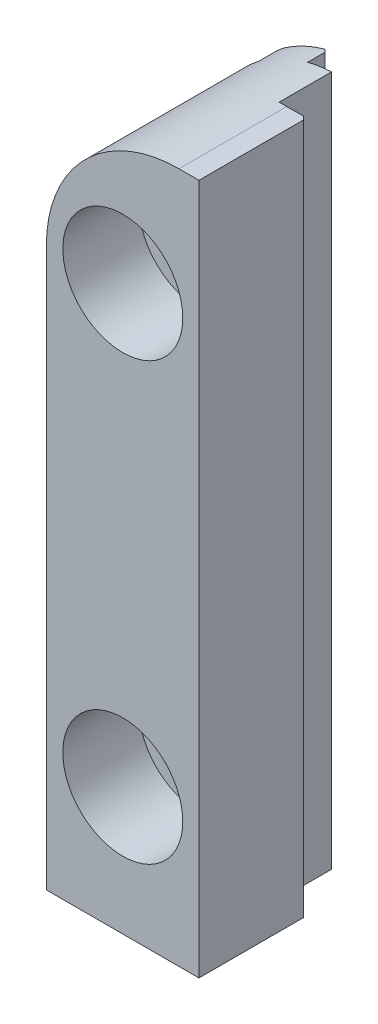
ISO-10303-21;
HEADER;
FILE_DESCRIPTION(('STEP AP214'),'2;1');
FILE_NAME('part.step','',(''),(''),'','','');
FILE_SCHEMA(('AUTOMOTIVE_DESIGN { 1 0 10303 214 1 1 1 1 }'));
ENDSEC;
DATA;
#1=APPLICATION_CONTEXT('core data for automotive mechanical design processes');
#2=APPLICATION_PROTOCOL_DEFINITION('international standard','automotive_design',2000,#1);
#3=PRODUCT_CONTEXT('',#1,'mechanical');
#4=PRODUCT('Part','Part','',(#3));
#5=PRODUCT_RELATED_PRODUCT_CATEGORY('part','',(#4));
#6=PRODUCT_DEFINITION_FORMATION('','',#4);
#7=PRODUCT_DEFINITION_CONTEXT('part definition',#1,'design');
#8=PRODUCT_DEFINITION('design','',#6,#7);
#9=PRODUCT_DEFINITION_SHAPE('','',#8);
#10=(LENGTH_UNIT() NAMED_UNIT(*) SI_UNIT(.MILLI.,.METRE.));
#11=(NAMED_UNIT(*) PLANE_ANGLE_UNIT() SI_UNIT($,.RADIAN.));
#12=(NAMED_UNIT(*) SI_UNIT($,.STERADIAN.) SOLID_ANGLE_UNIT());
#13=UNCERTAINTY_MEASURE_WITH_UNIT(LENGTH_MEASURE(1.E-05),#10,'distance_accuracy_value','');
#14=(GEOMETRIC_REPRESENTATION_CONTEXT(3) GLOBAL_UNCERTAINTY_ASSIGNED_CONTEXT((#13)) GLOBAL_UNIT_ASSIGNED_CONTEXT((#10,
#11,#12)) REPRESENTATION_CONTEXT('',''));
#15=CARTESIAN_POINT('',(0.,0.,0.));
#16=DIRECTION('',(0.,0.,1.));
#17=DIRECTION('',(1.,0.,0.));
#18=AXIS2_PLACEMENT_3D('',#15,#16,#17);
#19=CARTESIAN_POINT('',(-7.32028,25.146,-11.684));
#20=DIRECTION('',(0.,0.,-1.));
#21=DIRECTION('',(1.,0.,0.));
#22=AXIS2_PLACEMENT_3D('',#19,#20,#21);
#23=PLANE('',#22);
#24=CARTESIAN_POINT('',(-5.54228,-15.875,-11.684));
#25=DIRECTION('',(0.,0.,-1.));
#26=DIRECTION('',(-1.,0.,0.));
#27=AXIS2_PLACEMENT_3D('',#24,#25,#26);
#28=CIRCLE('',#27,2.7051);
#29=CARTESIAN_POINT('',(-8.24738,-15.875,-11.684));
#30=VERTEX_POINT('',#29);
#31=EDGE_CURVE('E486',#30,#30,#28,.F.);
#32=ORIENTED_EDGE('',*,*,#31,.T.);
#33=EDGE_LOOP('',(#32));
#34=FACE_BOUND('',#33,.T.);
#35=CARTESIAN_POINT('',(-5.54228,15.875,-11.684));
#36=DIRECTION('',(0.,0.,-1.));
#37=DIRECTION('',(-1.,0.,0.));
#38=AXIS2_PLACEMENT_3D('',#35,#36,#37);
#39=CIRCLE('',#38,2.7051);
#40=CARTESIAN_POINT('',(-8.24738,15.875,-11.684));
#41=VERTEX_POINT('',#40);
#42=EDGE_CURVE('E361',#41,#41,#39,.F.);
#43=ORIENTED_EDGE('',*,*,#42,.T.);
#44=EDGE_LOOP('',(#43));
#45=FACE_BOUND('',#44,.T.);
#46=CARTESIAN_POINT('',(-5.54228,-15.875,-11.684));
#47=DIRECTION('',(0.,0.,1.));
#48=DIRECTION('',(1.,0.,0.));
#49=AXIS2_PLACEMENT_3D('',#46,#47,#48);
#50=CIRCLE('',#49,3.175);
#51=CARTESIAN_POINT('',(-2.36728,-15.875,-11.684));
#52=VERTEX_POINT('',#51);
#53=CARTESIAN_POINT('',(-2.3672803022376,-15.8763853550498,-11.684));
#54=VERTEX_POINT('',#53);
#55=EDGE_CURVE('E333',#52,#54,#50,.T.);
#56=ORIENTED_EDGE('',*,*,#55,.F.);
#57=DIRECTION('',(-1.,0.,0.));
#58=VECTOR('',#57,1.);
#59=CARTESIAN_POINT('',(-7.32028,-15.875,-11.684));
#60=LINE('',#59,#58);
#61=CARTESIAN_POINT('',(-2.367026,-15.875,-11.684));
#62=VERTEX_POINT('',#61);
#63=EDGE_CURVE('E23',#52,#62,#60,.F.);
#64=ORIENTED_EDGE('',*,*,#63,.T.);
#65=CARTESIAN_POINT('',(-5.54228,-15.875,-11.684));
#66=DIRECTION('',(0.,0.,-1.));
#67=DIRECTION('',(-1.,0.,0.));
#68=AXIS2_PLACEMENT_3D('',#65,#66,#67);
#69=CIRCLE('',#68,3.175254);
#70=CARTESIAN_POINT('',(-3.76428,-13.2442293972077,-11.684));
#71=VERTEX_POINT('',#70);
#72=EDGE_CURVE('E243',#71,#62,#69,.T.);
#73=ORIENTED_EDGE('',*,*,#72,.F.);
#74=DIRECTION('',(0.,-1.,0.));
#75=VECTOR('',#74,1.);
#76=CARTESIAN_POINT('',(-3.76428,25.146,-11.684));
#77=LINE('',#76,#75);
#78=CARTESIAN_POINT('',(-3.76428,13.2442293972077,-11.684));
#79=VERTEX_POINT('',#78);
#80=EDGE_CURVE('E378',#79,#71,#77,.T.);
#81=ORIENTED_EDGE('',*,*,#80,.F.);
#82=CARTESIAN_POINT('',(-5.54228,15.875,-11.684));
#83=DIRECTION('',(0.,0.,-1.));
#84=DIRECTION('',(-1.,0.,0.));
#85=AXIS2_PLACEMENT_3D('',#82,#83,#84);
#86=CIRCLE('',#85,3.175254);
#87=CARTESIAN_POINT('',(-2.36702630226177,15.8736145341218,-11.684));
#88=VERTEX_POINT('',#87);
#89=EDGE_CURVE('E318',#88,#79,#86,.T.);
#90=ORIENTED_EDGE('',*,*,#89,.F.);
#91=DIRECTION('',(-0.999999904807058,0.000436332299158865,0.));
#92=VECTOR('',#91,1.);
#93=CARTESIAN_POINT('',(-7.32432489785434,15.8757775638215,-11.684));
#94=LINE('',#93,#92);
#95=CARTESIAN_POINT('',(-2.36728030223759,15.8736146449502,-11.684));
#96=VERTEX_POINT('',#95);
#97=EDGE_CURVE('E509',#88,#96,#94,.T.);
#98=ORIENTED_EDGE('',*,*,#97,.T.);
#99=CARTESIAN_POINT('',(-5.54228,15.875,-11.684));
#100=DIRECTION('',(0.,0.,1.));
#101=DIRECTION('',(1.,0.,0.));
#102=AXIS2_PLACEMENT_3D('',#99,#100,#101);
#103=CIRCLE('',#102,3.175);
#104=CARTESIAN_POINT('',(-2.36728,15.875,-11.684));
#105=VERTEX_POINT('',#104);
#106=EDGE_CURVE('E335',#105,#96,#103,.T.);
#107=ORIENTED_EDGE('',*,*,#106,.F.);
#108=DIRECTION('',(-1.,0.,0.));
#109=VECTOR('',#108,1.);
#110=CARTESIAN_POINT('',(-7.32028,15.875,-11.684));
#111=LINE('',#110,#109);
#112=CARTESIAN_POINT('',(-2.367026,15.875,-11.684));
#113=VERTEX_POINT('',#112);
#114=EDGE_CURVE('E506',#105,#113,#111,.F.);
#115=ORIENTED_EDGE('',*,*,#114,.T.);
#116=CARTESIAN_POINT('',(-3.76428,18.5057706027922,-11.684));
#117=VERTEX_POINT('',#116);
#118=EDGE_CURVE('E319',#117,#113,#86,.T.);
#119=ORIENTED_EDGE('',*,*,#118,.F.);
#120=CARTESIAN_POINT('',(-3.76428,24.8651543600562,-11.684));
#121=VERTEX_POINT('',#120);
#122=EDGE_CURVE('E374',#121,#117,#77,.T.);
#123=ORIENTED_EDGE('',*,*,#122,.F.);
#124=CARTESIAN_POINT('',(-1.45288,15.494,-11.684));
#125=DIRECTION('',(0.,0.,1.));
#126=DIRECTION('',(1.,0.,0.));
#127=AXIS2_PLACEMENT_3D('',#124,#125,#126);
#128=CIRCLE('',#127,9.652);
#129=CARTESIAN_POINT('',(-2.02438,25.1290657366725,-11.684));
#130=VERTEX_POINT('',#129);
#131=EDGE_CURVE('E392',#130,#121,#128,.T.);
#132=ORIENTED_EDGE('',*,*,#131,.F.);
#133=DIRECTION('',(0.,-1.,0.));
#134=VECTOR('',#133,1.);
#135=CARTESIAN_POINT('',(-2.02438,25.146,-11.684));
#136=LINE('',#135,#134);
#137=CARTESIAN_POINT('',(-2.02438,-25.146,-11.684));
#138=VERTEX_POINT('',#137);
#139=EDGE_CURVE('E377',#130,#138,#136,.T.);
#140=ORIENTED_EDGE('',*,*,#139,.T.);
#141=DIRECTION('',(-1.,0.,0.));
#142=VECTOR('',#141,1.);
#143=CARTESIAN_POINT('',(-1.96088,-25.146,-11.684));
#144=LINE('',#143,#142);
#145=CARTESIAN_POINT('',(-3.76428,-25.146,-11.684));
#146=VERTEX_POINT('',#145);
#147=EDGE_CURVE('E343',#138,#146,#144,.T.);
#148=ORIENTED_EDGE('',*,*,#147,.T.);
#149=CARTESIAN_POINT('',(-3.76428,-18.5057706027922,-11.684));
#150=VERTEX_POINT('',#149);
#151=EDGE_CURVE('E372',#150,#146,#77,.T.);
#152=ORIENTED_EDGE('',*,*,#151,.F.);
#153=CARTESIAN_POINT('',(-2.36702630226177,-15.8763854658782,-11.684));
#154=VERTEX_POINT('',#153);
#155=EDGE_CURVE('E270',#154,#150,#69,.T.);
#156=ORIENTED_EDGE('',*,*,#155,.F.);
#157=DIRECTION('',(-0.999999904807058,0.000436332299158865,0.));
#158=VECTOR('',#157,1.);
#159=CARTESIAN_POINT('',(-7.33817844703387,-15.874216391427,-11.684));
#160=LINE('',#159,#158);
#161=EDGE_CURVE('E9',#154,#54,#160,.T.);
#162=ORIENTED_EDGE('',*,*,#161,.T.);
#163=EDGE_LOOP('',(#56,#64,#73,#81,#90,#98,#107,#115,#119,#123,#132,#140,#148,#152,#156,#162));
#164=FACE_BOUND('',#163,.T.);
#165=ADVANCED_FACE('F15',(#34,#45,#164),#23,.T.);
#166=CARTESIAN_POINT('',(-7.32028,-18.5057706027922,-11.684));
#167=VERTEX_POINT('',#166);
#168=CARTESIAN_POINT('',(-7.32028,-13.2442293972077,-11.684));
#169=VERTEX_POINT('',#168);
#170=EDGE_CURVE('E273',#167,#169,#69,.T.);
#171=ORIENTED_EDGE('',*,*,#170,.F.);
#172=DIRECTION('',(0.,-1.,0.));
#173=VECTOR('',#172,1.);
#174=CARTESIAN_POINT('',(-7.32028,25.146,-11.684));
#175=LINE('',#174,#173);
#176=CARTESIAN_POINT('',(-7.32028,-25.146,-11.684));
#177=VERTEX_POINT('',#176);
#178=EDGE_CURVE('E367',#167,#177,#175,.T.);
#179=ORIENTED_EDGE('',*,*,#178,.T.);
#180=DIRECTION('',(-1.,0.,0.));
#181=VECTOR('',#180,1.);
#182=CARTESIAN_POINT('',(-7.32028,-25.146,-11.684));
#183=LINE('',#182,#181);
#184=CARTESIAN_POINT('',(-11.10488,-25.146,-11.684));
#185=VERTEX_POINT('',#184);
#186=EDGE_CURVE('E355',#177,#185,#183,.T.);
#187=ORIENTED_EDGE('',*,*,#186,.T.);
#188=DIRECTION('',(0.,-1.,0.));
#189=VECTOR('',#188,1.);
#190=CARTESIAN_POINT('',(-11.10488,25.146,-11.684));
#191=LINE('',#190,#189);
#192=CARTESIAN_POINT('',(-11.10488,15.494,-11.684));
#193=VERTEX_POINT('',#192);
#194=EDGE_CURVE('E365',#193,#185,#191,.T.);
#195=ORIENTED_EDGE('',*,*,#194,.F.);
#196=CARTESIAN_POINT('',(-1.45288,15.494,-11.684));
#197=DIRECTION('',(0.,0.,1.));
#198=DIRECTION('',(1.,0.,0.));
#199=AXIS2_PLACEMENT_3D('',#196,#197,#198);
#200=CIRCLE('',#199,9.652);
#201=CARTESIAN_POINT('',(-7.32028,23.1578581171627,-11.684));
#202=VERTEX_POINT('',#201);
#203=EDGE_CURVE('E397',#202,#193,#200,.T.);
#204=ORIENTED_EDGE('',*,*,#203,.F.);
#205=CARTESIAN_POINT('',(-7.32028,18.5057706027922,-11.684));
#206=VERTEX_POINT('',#205);
#207=EDGE_CURVE('E369',#202,#206,#175,.T.);
#208=ORIENTED_EDGE('',*,*,#207,.T.);
#209=CARTESIAN_POINT('',(-7.32028,13.2442293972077,-11.684));
#210=VERTEX_POINT('',#209);
#211=EDGE_CURVE('E315',#210,#206,#86,.T.);
#212=ORIENTED_EDGE('',*,*,#211,.F.);
#213=EDGE_CURVE('E373',#210,#169,#175,.T.);
#214=ORIENTED_EDGE('',*,*,#213,.T.);
#215=EDGE_LOOP('',(#171,#179,#187,#195,#204,#208,#212,#214));
#216=FACE_BOUND('',#215,.T.);
#217=ADVANCED_FACE('F552',(#216),#23,.T.);
#218=CARTESIAN_POINT('',(-3.76428,25.146,-11.684));
#219=DIRECTION('',(1.,0.,0.));
#220=DIRECTION('',(0.,0.,1.));
#221=AXIS2_PLACEMENT_3D('',#218,#219,#220);
#222=PLANE('',#221);
#223=DIRECTION('',(0.,0.,1.));
#224=VECTOR('',#223,1.);
#225=CARTESIAN_POINT('',(-3.76428,-18.5057706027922,-5.5372));
#226=LINE('',#225,#224);
#227=CARTESIAN_POINT('',(-3.76428,-18.5057706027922,-12.954));
#228=VERTEX_POINT('',#227);
#229=EDGE_CURVE('E38',#150,#228,#226,.F.);
#230=ORIENTED_EDGE('',*,*,#229,.F.);
#231=ORIENTED_EDGE('',*,*,#151,.T.);
#232=DIRECTION('',(0.,0.,-1.));
#233=VECTOR('',#232,1.);
#234=CARTESIAN_POINT('',(-3.76428,-25.146,-11.684));
#235=LINE('',#234,#233);
#236=CARTESIAN_POINT('',(-3.76428,-25.146,-12.954));
#237=VERTEX_POINT('',#236);
#238=EDGE_CURVE('E346',#146,#237,#235,.T.);
#239=ORIENTED_EDGE('',*,*,#238,.T.);
#240=DIRECTION('',(0.,1.,0.));
#241=VECTOR('',#240,1.);
#242=CARTESIAN_POINT('',(-3.76428,25.146,-12.954));
#243=LINE('',#242,#241);
#244=EDGE_CURVE('E444',#237,#228,#243,.T.);
#245=ORIENTED_EDGE('',*,*,#244,.T.);
#246=EDGE_LOOP('',(#230,#231,#239,#245));
#247=FACE_BOUND('',#246,.T.);
#248=ADVANCED_FACE('F524',(#247),#222,.T.);
#249=CARTESIAN_POINT('',(-3.76428,25.146,-13.208));
#250=DIRECTION('',(0.,0.,-1.));
#251=DIRECTION('',(1.,0.,0.));
#252=AXIS2_PLACEMENT_3D('',#249,#250,#251);
#253=PLANE('',#252);
#254=CARTESIAN_POINT('',(-5.54228,-15.875,-13.208));
#255=DIRECTION('',(0.,0.,-1.));
#256=DIRECTION('',(-1.,0.,0.));
#257=AXIS2_PLACEMENT_3D('',#254,#255,#256);
#258=CIRCLE('',#257,3.175254);
#259=CARTESIAN_POINT('',(-7.06628,-13.0893830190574,-13.208));
#260=VERTEX_POINT('',#259);
#261=CARTESIAN_POINT('',(-4.01828,-13.0893830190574,-13.208));
#262=VERTEX_POINT('',#261);
#263=EDGE_CURVE('E281',#260,#262,#258,.T.);
#264=ORIENTED_EDGE('',*,*,#263,.F.);
#265=DIRECTION('',(0.,1.,0.));
#266=VECTOR('',#265,1.);
#267=CARTESIAN_POINT('',(-7.06628,25.146,-13.208));
#268=LINE('',#267,#266);
#269=CARTESIAN_POINT('',(-7.06628,13.0893830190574,-13.208));
#270=VERTEX_POINT('',#269);
#271=EDGE_CURVE('E414',#260,#270,#268,.T.);
#272=ORIENTED_EDGE('',*,*,#271,.T.);
#273=CARTESIAN_POINT('',(-5.54228,15.875,-13.208));
#274=DIRECTION('',(0.,0.,-1.));
#275=DIRECTION('',(-1.,0.,0.));
#276=AXIS2_PLACEMENT_3D('',#273,#274,#275);
#277=CIRCLE('',#276,3.175254);
#278=CARTESIAN_POINT('',(-4.01828,13.0893830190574,-13.208));
#279=VERTEX_POINT('',#278);
#280=EDGE_CURVE('E325',#279,#270,#277,.T.);
#281=ORIENTED_EDGE('',*,*,#280,.F.);
#282=DIRECTION('',(0.,-1.,0.));
#283=VECTOR('',#282,1.);
#284=CARTESIAN_POINT('',(-4.01828,25.146,-13.208));
#285=LINE('',#284,#283);
#286=EDGE_CURVE('E411',#279,#262,#285,.T.);
#287=ORIENTED_EDGE('',*,*,#286,.T.);
#288=EDGE_LOOP('',(#264,#272,#281,#287));
#289=FACE_BOUND('',#288,.T.);
#290=ADVANCED_FACE('F566',(#289),#253,.T.);
#291=CARTESIAN_POINT('',(-7.32028,25.146,-13.208));
#292=DIRECTION('',(-1.,0.,0.));
#293=DIRECTION('',(0.,0.,-1.));
#294=AXIS2_PLACEMENT_3D('',#291,#292,#293);
#295=PLANE('',#294);
#296=DIRECTION('',(0.,0.,1.));
#297=VECTOR('',#296,1.);
#298=CARTESIAN_POINT('',(-7.32028,-13.2442293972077,-5.5372));
#299=LINE('',#298,#297);
#300=CARTESIAN_POINT('',(-7.32028,-13.2442293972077,-12.954));
#301=VERTEX_POINT('',#300);
#302=EDGE_CURVE('E277',#169,#301,#299,.F.);
#303=ORIENTED_EDGE('',*,*,#302,.F.);
#304=ORIENTED_EDGE('',*,*,#213,.F.);
#305=DIRECTION('',(0.,0.,1.));
#306=VECTOR('',#305,1.);
#307=CARTESIAN_POINT('',(-7.32028,13.2442293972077,-5.5372));
#308=LINE('',#307,#306);
#309=CARTESIAN_POINT('',(-7.32028,13.2442293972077,-12.954));
#310=VERTEX_POINT('',#309);
#311=EDGE_CURVE('E321',#310,#210,#308,.T.);
#312=ORIENTED_EDGE('',*,*,#311,.F.);
#313=DIRECTION('',(0.,-1.,0.));
#314=VECTOR('',#313,1.);
#315=CARTESIAN_POINT('',(-7.32028,25.146,-12.954));
#316=LINE('',#315,#314);
#317=EDGE_CURVE('E400',#310,#301,#316,.T.);
#318=ORIENTED_EDGE('',*,*,#317,.T.);
#319=EDGE_LOOP('',(#303,#304,#312,#318));
#320=FACE_BOUND('',#319,.T.);
#321=ADVANCED_FACE('F556',(#320),#295,.T.);
#322=DIRECTION('',(0.,0.,1.));
#323=VECTOR('',#322,1.);
#324=CARTESIAN_POINT('',(-3.76428,-13.2442293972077,-5.5372));
#325=LINE('',#324,#323);
#326=CARTESIAN_POINT('',(-3.76428,-13.2442293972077,-12.954));
#327=VERTEX_POINT('',#326);
#328=EDGE_CURVE('E285',#327,#71,#325,.T.);
#329=ORIENTED_EDGE('',*,*,#328,.F.);
#330=DIRECTION('',(0.,1.,0.));
#331=VECTOR('',#330,1.);
#332=CARTESIAN_POINT('',(-3.76428,25.146,-12.954));
#333=LINE('',#332,#331);
#334=CARTESIAN_POINT('',(-3.76428,13.2442293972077,-12.954));
#335=VERTEX_POINT('',#334);
#336=EDGE_CURVE('E416',#327,#335,#333,.T.);
#337=ORIENTED_EDGE('',*,*,#336,.T.);
#338=DIRECTION('',(0.,0.,1.));
#339=VECTOR('',#338,1.);
#340=CARTESIAN_POINT('',(-3.76428,13.2442293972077,-5.5372));
#341=LINE('',#340,#339);
#342=EDGE_CURVE('E330',#79,#335,#341,.F.);
#343=ORIENTED_EDGE('',*,*,#342,.F.);
#344=ORIENTED_EDGE('',*,*,#80,.T.);
#345=EDGE_LOOP('',(#329,#337,#343,#344));
#346=FACE_BOUND('',#345,.T.);
#347=ADVANCED_FACE('F578',(#346),#222,.T.);
#348=CARTESIAN_POINT('',(-5.54228,15.875,-13.208));
#349=DIRECTION('',(0.,0.,-1.));
#350=DIRECTION('',(-1.,0.,0.));
#351=AXIS2_PLACEMENT_3D('',#348,#349,#350);
#352=CIRCLE('',#351,3.175254);
#353=CARTESIAN_POINT('',(-7.06628,18.6606169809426,-13.208));
#354=VERTEX_POINT('',#353);
#355=CARTESIAN_POINT('',(-4.01828,18.6606169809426,-13.208));
#356=VERTEX_POINT('',#355);
#357=EDGE_CURVE('E311',#354,#356,#352,.T.);
#358=ORIENTED_EDGE('',*,*,#357,.F.);
#359=DIRECTION('',(0.,1.,0.));
#360=VECTOR('',#359,1.);
#361=CARTESIAN_POINT('',(-7.06628,25.146,-13.208));
#362=LINE('',#361,#360);
#363=CARTESIAN_POINT('',(-7.06628,23.3458051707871,-13.208));
#364=VERTEX_POINT('',#363);
#365=EDGE_CURVE('E418',#354,#364,#362,.T.);
#366=ORIENTED_EDGE('',*,*,#365,.T.);
#367=CARTESIAN_POINT('',(-1.45288,15.494,-13.208));
#368=DIRECTION('',(0.,0.,1.));
#369=DIRECTION('',(1.,0.,0.));
#370=AXIS2_PLACEMENT_3D('',#367,#368,#369);
#371=CIRCLE('',#370,9.652);
#372=CARTESIAN_POINT('',(-4.01828,24.7988281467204,-13.208));
#373=VERTEX_POINT('',#372);
#374=EDGE_CURVE('E391',#373,#364,#371,.T.);
#375=ORIENTED_EDGE('',*,*,#374,.F.);
#376=DIRECTION('',(0.,-1.,0.));
#377=VECTOR('',#376,1.);
#378=CARTESIAN_POINT('',(-4.01828,25.146,-13.208));
#379=LINE('',#378,#377);
#380=EDGE_CURVE('E420',#373,#356,#379,.T.);
#381=ORIENTED_EDGE('',*,*,#380,.T.);
#382=EDGE_LOOP('',(#358,#366,#375,#381));
#383=FACE_BOUND('',#382,.T.);
#384=ADVANCED_FACE('F644',(#383),#253,.T.);
#385=DIRECTION('',(0.,0.,1.));
#386=VECTOR('',#385,1.);
#387=CARTESIAN_POINT('',(-7.32028,18.5057706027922,-5.5372));
#388=LINE('',#387,#386);
#389=CARTESIAN_POINT('',(-7.32028,18.5057706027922,-12.954));
#390=VERTEX_POINT('',#389);
#391=EDGE_CURVE('E308',#206,#390,#388,.F.);
#392=ORIENTED_EDGE('',*,*,#391,.F.);
#393=ORIENTED_EDGE('',*,*,#207,.F.);
#394=DIRECTION('',(0.,0.,1.));
#395=VECTOR('',#394,1.);
#396=CARTESIAN_POINT('',(-7.32028,23.1578581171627,-13.208));
#397=LINE('',#396,#395);
#398=CARTESIAN_POINT('',(-7.32028,23.1578581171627,-12.954));
#399=VERTEX_POINT('',#398);
#400=EDGE_CURVE('E395',#399,#202,#397,.T.);
#401=ORIENTED_EDGE('',*,*,#400,.F.);
#402=DIRECTION('',(0.,-1.,0.));
#403=VECTOR('',#402,1.);
#404=CARTESIAN_POINT('',(-7.32028,25.146,-12.954));
#405=LINE('',#404,#403);
#406=EDGE_CURVE('E437',#399,#390,#405,.T.);
#407=ORIENTED_EDGE('',*,*,#406,.T.);
#408=EDGE_LOOP('',(#392,#393,#401,#407));
#409=FACE_BOUND('',#408,.T.);
#410=ADVANCED_FACE('F636',(#409),#295,.T.);
#411=CARTESIAN_POINT('',(-11.10488,25.146,-11.684));
#412=DIRECTION('',(-1.,0.,0.));
#413=DIRECTION('',(0.,0.,-1.));
#414=AXIS2_PLACEMENT_3D('',#411,#412,#413);
#415=PLANE('',#414);
#416=DIRECTION('',(0.,0.,1.));
#417=VECTOR('',#416,1.);
#418=CARTESIAN_POINT('',(-11.10488,15.494,-11.684));
#419=LINE('',#418,#417);
#420=CARTESIAN_POINT('',(-11.10488,15.494,0.));
#421=VERTEX_POINT('',#420);
#422=EDGE_CURVE('E382',#193,#421,#419,.T.);
#423=ORIENTED_EDGE('',*,*,#422,.F.);
#424=ORIENTED_EDGE('',*,*,#194,.T.);
#425=DIRECTION('',(0.,0.,1.));
#426=VECTOR('',#425,1.);
#427=CARTESIAN_POINT('',(-11.10488,-25.146,-11.684));
#428=LINE('',#427,#426);
#429=CARTESIAN_POINT('',(-11.10488,-25.146,0.));
#430=VERTEX_POINT('',#429);
#431=EDGE_CURVE('E342',#185,#430,#428,.T.);
#432=ORIENTED_EDGE('',*,*,#431,.T.);
#433=DIRECTION('',(0.,-1.,0.));
#434=VECTOR('',#433,1.);
#435=CARTESIAN_POINT('',(-11.10488,25.146,0.));
#436=LINE('',#435,#434);
#437=EDGE_CURVE('E379',#421,#430,#436,.T.);
#438=ORIENTED_EDGE('',*,*,#437,.F.);
#439=EDGE_LOOP('',(#423,#424,#432,#438));
#440=FACE_BOUND('',#439,.T.);
#441=ADVANCED_FACE('F615',(#440),#415,.T.);
#442=CARTESIAN_POINT('',(-11.10488,25.146,0.));
#443=DIRECTION('',(0.,0.,1.));
#444=DIRECTION('',(-1.,0.,0.));
#445=AXIS2_PLACEMENT_3D('',#442,#443,#444);
#446=PLANE('',#445);
#447=CARTESIAN_POINT('',(-5.54228,-15.875,0.));
#448=DIRECTION('',(0.,0.,1.));
#449=DIRECTION('',(1.,0.,0.));
#450=AXIS2_PLACEMENT_3D('',#447,#448,#449);
#451=CIRCLE('',#450,4.365625);
#452=CARTESIAN_POINT('',(-1.176655,-15.875,0.));
#453=VERTEX_POINT('',#452);
#454=EDGE_CURVE('E337',#453,#453,#451,.F.);
#455=ORIENTED_EDGE('',*,*,#454,.T.);
#456=EDGE_LOOP('',(#455));
#457=FACE_BOUND('',#456,.T.);
#458=CARTESIAN_POINT('',(-5.54228,15.875,0.));
#459=DIRECTION('',(0.,0.,1.));
#460=DIRECTION('',(1.,0.,0.));
#461=AXIS2_PLACEMENT_3D('',#458,#459,#460);
#462=CIRCLE('',#461,4.365625);
#463=CARTESIAN_POINT('',(-1.176655,15.875,0.));
#464=VERTEX_POINT('',#463);
#465=EDGE_CURVE('E490',#464,#464,#462,.F.);
#466=ORIENTED_EDGE('',*,*,#465,.T.);
#467=EDGE_LOOP('',(#466));
#468=FACE_BOUND('',#467,.T.);
#469=ORIENTED_EDGE('',*,*,#437,.T.);
#470=DIRECTION('',(1.,0.,0.));
#471=VECTOR('',#470,1.);
#472=CARTESIAN_POINT('',(-11.10488,-25.146,0.));
#473=LINE('',#472,#471);
#474=CARTESIAN_POINT('',(0.,-25.146,0.));
#475=VERTEX_POINT('',#474);
#476=EDGE_CURVE('E338',#430,#475,#473,.T.);
#477=ORIENTED_EDGE('',*,*,#476,.T.);
#478=DIRECTION('',(0.,-1.,0.));
#479=VECTOR('',#478,1.);
#480=CARTESIAN_POINT('',(0.,25.146,0.));
#481=LINE('',#480,#479);
#482=CARTESIAN_POINT('',(0.,25.146,0.));
#483=VERTEX_POINT('',#482);
#484=EDGE_CURVE('E383',#483,#475,#481,.T.);
#485=ORIENTED_EDGE('',*,*,#484,.F.);
#486=DIRECTION('',(1.,0.,0.));
#487=VECTOR('',#486,1.);
#488=CARTESIAN_POINT('',(-11.10488,25.146,0.));
#489=LINE('',#488,#487);
#490=CARTESIAN_POINT('',(-1.45288,25.146,0.));
#491=VERTEX_POINT('',#490);
#492=EDGE_CURVE('E358',#491,#483,#489,.T.);
#493=ORIENTED_EDGE('',*,*,#492,.F.);
#494=CARTESIAN_POINT('',(-1.45288,15.494,0.));
#495=DIRECTION('',(0.,0.,-1.));
#496=DIRECTION('',(-1.,0.,0.));
#497=AXIS2_PLACEMENT_3D('',#494,#495,#496);
#498=CIRCLE('',#497,9.652);
#499=EDGE_CURVE('E384',#421,#491,#498,.T.);
#500=ORIENTED_EDGE('',*,*,#499,.F.);
#501=EDGE_LOOP('',(#469,#477,#485,#493,#500));
#502=FACE_BOUND('',#501,.T.);
#503=ADVANCED_FACE('F611',(#457,#468,#502),#446,.T.);
#504=CARTESIAN_POINT('',(0.,25.146,0.));
#505=DIRECTION('',(1.,0.,0.));
#506=DIRECTION('',(0.,0.,1.));
#507=AXIS2_PLACEMENT_3D('',#504,#505,#506);
#508=PLANE('',#507);
#509=DIRECTION('',(0.,0.,-1.));
#510=VECTOR('',#509,1.);
#511=CARTESIAN_POINT('',(0.,-25.146,0.));
#512=LINE('',#511,#510);
#513=CARTESIAN_POINT('',(0.,-25.146,-7.60476));
#514=VERTEX_POINT('',#513);
#515=EDGE_CURVE('E341',#475,#514,#512,.T.);
#516=ORIENTED_EDGE('',*,*,#515,.T.);
#517=DIRECTION('',(0.,1.,0.));
#518=VECTOR('',#517,1.);
#519=CARTESIAN_POINT('',(0.,25.146,-7.60476));
#520=LINE('',#519,#518);
#521=CARTESIAN_POINT('',(0.,25.146,-7.60476));
#522=VERTEX_POINT('',#521);
#523=EDGE_CURVE('E476',#514,#522,#520,.T.);
#524=ORIENTED_EDGE('',*,*,#523,.T.);
#525=DIRECTION('',(0.,0.,-1.));
#526=VECTOR('',#525,1.);
#527=CARTESIAN_POINT('',(0.,25.146,0.));
#528=LINE('',#527,#526);
#529=EDGE_CURVE('E364',#483,#522,#528,.T.);
#530=ORIENTED_EDGE('',*,*,#529,.F.);
#531=ORIENTED_EDGE('',*,*,#484,.T.);
#532=EDGE_LOOP('',(#516,#524,#530,#531));
#533=FACE_BOUND('',#532,.T.);
#534=ADVANCED_FACE('F614',(#533),#508,.T.);
#535=CARTESIAN_POINT('',(0.00380999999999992,25.146,-7.85876));
#536=DIRECTION('',(0.,0.,-1.));
#537=DIRECTION('',(1.,0.,0.));
#538=AXIS2_PLACEMENT_3D('',#535,#536,#537);
#539=PLANE('',#538);
#540=DIRECTION('',(-1.,0.,0.));
#541=VECTOR('',#540,1.);
#542=CARTESIAN_POINT('',(-11.10488,25.146,-7.85876));
#543=LINE('',#542,#541);
#544=CARTESIAN_POINT('',(-0.254,25.146,-7.85876));
#545=VERTEX_POINT('',#544);
#546=CARTESIAN_POINT('',(-1.45288,25.146,-7.84352));
#547=VERTEX_POINT('',#546);
#548=EDGE_CURVE('E368',#545,#547,#543,.T.);
#549=ORIENTED_EDGE('',*,*,#548,.F.);
#550=DIRECTION('',(0.,-1.,0.));
#551=VECTOR('',#550,1.);
#552=CARTESIAN_POINT('',(-0.254,25.146,-7.85876));
#553=LINE('',#552,#551);
#554=CARTESIAN_POINT('',(-0.254,-25.146,-7.85876));
#555=VERTEX_POINT('',#554);
#556=EDGE_CURVE('E447',#545,#555,#553,.T.);
#557=ORIENTED_EDGE('',*,*,#556,.T.);
#558=DIRECTION('',(-1.,0.,0.));
#559=VECTOR('',#558,1.);
#560=CARTESIAN_POINT('',(-11.10488,-25.146,-7.85876));
#561=LINE('',#560,#559);
#562=CARTESIAN_POINT('',(-2.02438,-25.146,-7.85876));
#563=VERTEX_POINT('',#562);
#564=EDGE_CURVE('E403',#555,#563,#561,.T.);
#565=ORIENTED_EDGE('',*,*,#564,.T.);
#566=DIRECTION('',(0.,-1.,0.));
#567=VECTOR('',#566,1.);
#568=CARTESIAN_POINT('',(-2.02438,25.146,-7.85876));
#569=LINE('',#568,#567);
#570=CARTESIAN_POINT('',(-2.02438,25.1290657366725,-7.84352));
#571=VERTEX_POINT('',#570);
#572=EDGE_CURVE('E408',#571,#563,#569,.T.);
#573=ORIENTED_EDGE('',*,*,#572,.F.);
#574=CARTESIAN_POINT('',(-1.45288,15.494,-7.85876));
#575=DIRECTION('',(0.,0.,-1.));
#576=DIRECTION('',(-1.,0.,0.));
#577=AXIS2_PLACEMENT_3D('',#574,#575,#576);
#578=CIRCLE('',#577,9.652);
#579=EDGE_CURVE('E456',#547,#571,#578,.F.);
#580=ORIENTED_EDGE('',*,*,#579,.F.);
#581=EDGE_LOOP('',(#549,#557,#565,#573,#580));
#582=FACE_BOUND('',#581,.T.);
#583=ADVANCED_FACE('F664',(#582),#539,.T.);
#584=CARTESIAN_POINT('',(-2.02438,25.146,-7.84352));
#585=DIRECTION('',(1.,0.,0.));
#586=DIRECTION('',(0.,0.,1.));
#587=AXIS2_PLACEMENT_3D('',#584,#585,#586);
#588=PLANE('',#587);
#589=DIRECTION('',(0.,0.,-1.));
#590=VECTOR('',#589,1.);
#591=CARTESIAN_POINT('',(-2.02438,-25.146,-7.84352));
#592=LINE('',#591,#590);
#593=EDGE_CURVE('E347',#563,#138,#592,.T.);
#594=ORIENTED_EDGE('',*,*,#593,.T.);
#595=ORIENTED_EDGE('',*,*,#139,.F.);
#596=DIRECTION('',(0.,0.,1.));
#597=VECTOR('',#596,1.);
#598=CARTESIAN_POINT('',(-2.02438,25.1290657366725,-11.684));
#599=LINE('',#598,#597);
#600=EDGE_CURVE('E450',#571,#130,#599,.F.);
#601=ORIENTED_EDGE('',*,*,#600,.F.);
#602=ORIENTED_EDGE('',*,*,#572,.T.);
#603=EDGE_LOOP('',(#594,#595,#601,#602));
#604=FACE_BOUND('',#603,.T.);
#605=ADVANCED_FACE('F659',(#604),#588,.T.);
#606=DIRECTION('',(0.,0.,1.));
#607=VECTOR('',#606,1.);
#608=CARTESIAN_POINT('',(-3.76428,18.5057706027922,-5.5372));
#609=LINE('',#608,#607);
#610=CARTESIAN_POINT('',(-3.76428,18.5057706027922,-12.954));
#611=VERTEX_POINT('',#610);
#612=EDGE_CURVE('E317',#611,#117,#609,.T.);
#613=ORIENTED_EDGE('',*,*,#612,.F.);
#614=DIRECTION('',(0.,1.,0.));
#615=VECTOR('',#614,1.);
#616=CARTESIAN_POINT('',(-3.76428,25.146,-12.954));
#617=LINE('',#616,#615);
#618=CARTESIAN_POINT('',(-3.76428,24.8651543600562,-12.954));
#619=VERTEX_POINT('',#618);
#620=EDGE_CURVE('E423',#611,#619,#617,.T.);
#621=ORIENTED_EDGE('',*,*,#620,.T.);
#622=DIRECTION('',(0.,0.,1.));
#623=VECTOR('',#622,1.);
#624=CARTESIAN_POINT('',(-3.76428,24.8651543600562,-11.684));
#625=LINE('',#624,#623);
#626=EDGE_CURVE('E388',#121,#619,#625,.F.);
#627=ORIENTED_EDGE('',*,*,#626,.F.);
#628=ORIENTED_EDGE('',*,*,#122,.T.);
#629=EDGE_LOOP('',(#613,#621,#627,#628));
#630=FACE_BOUND('',#629,.T.);
#631=ADVANCED_FACE('F652',(#630),#222,.T.);
#632=CARTESIAN_POINT('',(-5.54228,-15.875,-13.208));
#633=DIRECTION('',(0.,0.,-1.));
#634=DIRECTION('',(-1.,0.,0.));
#635=AXIS2_PLACEMENT_3D('',#632,#633,#634);
#636=CIRCLE('',#635,3.175254);
#637=CARTESIAN_POINT('',(-4.01828,-18.6606169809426,-13.208));
#638=VERTEX_POINT('',#637);
#639=CARTESIAN_POINT('',(-7.06628,-18.6606169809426,-13.208));
#640=VERTEX_POINT('',#639);
#641=EDGE_CURVE('E252',#638,#640,#636,.T.);
#642=ORIENTED_EDGE('',*,*,#641,.F.);
#643=DIRECTION('',(0.,-1.,0.));
#644=VECTOR('',#643,1.);
#645=CARTESIAN_POINT('',(-4.01828,25.146,-13.208));
#646=LINE('',#645,#644);
#647=CARTESIAN_POINT('',(-4.01828,-25.146,-13.208));
#648=VERTEX_POINT('',#647);
#649=EDGE_CURVE('E440',#638,#648,#646,.T.);
#650=ORIENTED_EDGE('',*,*,#649,.T.);
#651=DIRECTION('',(-1.,0.,0.));
#652=VECTOR('',#651,1.);
#653=CARTESIAN_POINT('',(-3.76428,-25.146,-13.208));
#654=LINE('',#653,#652);
#655=CARTESIAN_POINT('',(-7.06628,-25.146,-13.208));
#656=VERTEX_POINT('',#655);
#657=EDGE_CURVE('E350',#648,#656,#654,.T.);
#658=ORIENTED_EDGE('',*,*,#657,.T.);
#659=DIRECTION('',(0.,1.,0.));
#660=VECTOR('',#659,1.);
#661=CARTESIAN_POINT('',(-7.06628,25.146,-13.208));
#662=LINE('',#661,#660);
#663=EDGE_CURVE('E434',#656,#640,#662,.T.);
#664=ORIENTED_EDGE('',*,*,#663,.T.);
#665=EDGE_LOOP('',(#642,#650,#658,#664));
#666=FACE_BOUND('',#665,.T.);
#667=ADVANCED_FACE('F535',(#666),#253,.T.);
#668=DIRECTION('',(0.,0.,1.));
#669=VECTOR('',#668,1.);
#670=CARTESIAN_POINT('',(-7.32028,-18.5057706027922,-5.5372));
#671=LINE('',#670,#669);
#672=CARTESIAN_POINT('',(-7.32028,-18.5057706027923,-12.954));
#673=VERTEX_POINT('',#672);
#674=EDGE_CURVE('E275',#673,#167,#671,.T.);
#675=ORIENTED_EDGE('',*,*,#674,.F.);
#676=DIRECTION('',(0.,-1.,0.));
#677=VECTOR('',#676,1.);
#678=CARTESIAN_POINT('',(-7.32028,25.146,-12.954));
#679=LINE('',#678,#677);
#680=CARTESIAN_POINT('',(-7.32028,-25.146,-12.954));
#681=VERTEX_POINT('',#680);
#682=EDGE_CURVE('E429',#673,#681,#679,.T.);
#683=ORIENTED_EDGE('',*,*,#682,.T.);
#684=DIRECTION('',(0.,0.,1.));
#685=VECTOR('',#684,1.);
#686=CARTESIAN_POINT('',(-7.32028,-25.146,-13.208));
#687=LINE('',#686,#685);
#688=EDGE_CURVE('E352',#681,#177,#687,.T.);
#689=ORIENTED_EDGE('',*,*,#688,.T.);
#690=ORIENTED_EDGE('',*,*,#178,.F.);
#691=EDGE_LOOP('',(#675,#683,#689,#690));
#692=FACE_BOUND('',#691,.T.);
#693=ADVANCED_FACE('F546',(#692),#295,.T.);
#694=CARTESIAN_POINT('',(-11.10488,25.146,-7.84352));
#695=DIRECTION('',(0.,1.,0.));
#696=DIRECTION('',(0.,0.,1.));
#697=AXIS2_PLACEMENT_3D('',#694,#695,#696);
#698=PLANE('',#697);
#699=ORIENTED_EDGE('',*,*,#529,.T.);
#700=DIRECTION('',(0.707106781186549,0.,0.707106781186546));
#701=VECTOR('',#700,1.);
#702=CARTESIAN_POINT('',(-5.67182,25.146,-13.27658));
#703=LINE('',#702,#701);
#704=EDGE_CURVE('E478',#522,#545,#703,.F.);
#705=ORIENTED_EDGE('',*,*,#704,.T.);
#706=ORIENTED_EDGE('',*,*,#548,.T.);
#707=DIRECTION('',(0.,0.,1.));
#708=VECTOR('',#707,1.);
#709=CARTESIAN_POINT('',(-1.45288,25.146,-7.84352));
#710=LINE('',#709,#708);
#711=EDGE_CURVE('E387',#491,#547,#710,.F.);
#712=ORIENTED_EDGE('',*,*,#711,.F.);
#713=ORIENTED_EDGE('',*,*,#492,.T.);
#714=EDGE_LOOP('',(#699,#705,#706,#712,#713));
#715=FACE_BOUND('',#714,.T.);
#716=ADVANCED_FACE('F672',(#715),#698,.T.);
#717=CARTESIAN_POINT('',(-11.10488,-25.146,-7.84352));
#718=DIRECTION('',(0.,1.,0.));
#719=DIRECTION('',(0.,0.,1.));
#720=AXIS2_PLACEMENT_3D('',#717,#718,#719);
#721=PLANE('',#720);
#722=ORIENTED_EDGE('',*,*,#564,.F.);
#723=DIRECTION('',(-0.707106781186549,0.,-0.707106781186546));
#724=VECTOR('',#723,1.);
#725=CARTESIAN_POINT('',(-0.254,-25.146,-7.85876));
#726=LINE('',#725,#724);
#727=EDGE_CURVE('E474',#555,#514,#726,.F.);
#728=ORIENTED_EDGE('',*,*,#727,.T.);
#729=ORIENTED_EDGE('',*,*,#515,.F.);
#730=ORIENTED_EDGE('',*,*,#476,.F.);
#731=ORIENTED_EDGE('',*,*,#431,.F.);
#732=ORIENTED_EDGE('',*,*,#186,.F.);
#733=ORIENTED_EDGE('',*,*,#688,.F.);
#734=DIRECTION('',(-0.707106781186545,0.,0.70710678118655));
#735=VECTOR('',#734,1.);
#736=CARTESIAN_POINT('',(-7.32028,-25.146,-12.954));
#737=LINE('',#736,#735);
#738=EDGE_CURVE('E431',#681,#656,#737,.F.);
#739=ORIENTED_EDGE('',*,*,#738,.T.);
#740=ORIENTED_EDGE('',*,*,#657,.F.);
#741=DIRECTION('',(-0.70710678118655,0.,-0.707106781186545));
#742=VECTOR('',#741,1.);
#743=CARTESIAN_POINT('',(-4.01828,-25.146,-13.208));
#744=LINE('',#743,#742);
#745=EDGE_CURVE('E442',#648,#237,#744,.F.);
#746=ORIENTED_EDGE('',*,*,#745,.T.);
#747=ORIENTED_EDGE('',*,*,#238,.F.);
#748=ORIENTED_EDGE('',*,*,#147,.F.);
#749=ORIENTED_EDGE('',*,*,#593,.F.);
#750=EDGE_LOOP('',(#722,#728,#729,#730,#731,#732,#733,#739,#740,#746,#747,#748,#749));
#751=FACE_BOUND('',#750,.T.);
#752=ADVANCED_FACE('F626',(#751),#721,.F.);
#753=CARTESIAN_POINT('',(-1.45288,15.494,-11.684));
#754=DIRECTION('',(0.,0.,1.));
#755=DIRECTION('',(0.,-1.,0.));
#756=AXIS2_PLACEMENT_3D('',#753,#754,#755);
#757=CYLINDRICAL_SURFACE('',#756,9.652);
#758=ORIENTED_EDGE('',*,*,#626,.T.);
#759=CARTESIAN_POINT('',(-1.45288,15.494,-10.6426));
#760=DIRECTION('',(-0.707106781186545,0.,0.70710678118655));
#761=DIRECTION('',(0.70710678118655,0.,0.707106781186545));
#762=AXIS2_PLACEMENT_3D('',#759,#760,#761);
#763=ELLIPSE('',#762,13.6499893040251,9.652);
#764=EDGE_CURVE('E427',#619,#373,#763,.T.);
#765=ORIENTED_EDGE('',*,*,#764,.T.);
#766=ORIENTED_EDGE('',*,*,#374,.T.);
#767=CARTESIAN_POINT('',(-1.45288,15.494,-18.8214));
#768=DIRECTION('',(0.70710678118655,0.,0.707106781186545));
#769=DIRECTION('',(-0.707106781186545,0.,0.70710678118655));
#770=AXIS2_PLACEMENT_3D('',#767,#768,#769);
#771=ELLIPSE('',#770,13.6499893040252,9.652);
#772=EDGE_CURVE('E425',#364,#399,#771,.T.);
#773=ORIENTED_EDGE('',*,*,#772,.T.);
#774=ORIENTED_EDGE('',*,*,#400,.T.);
#775=ORIENTED_EDGE('',*,*,#203,.T.);
#776=ORIENTED_EDGE('',*,*,#422,.T.);
#777=ORIENTED_EDGE('',*,*,#499,.T.);
#778=ORIENTED_EDGE('',*,*,#711,.T.);
#779=ORIENTED_EDGE('',*,*,#579,.T.);
#780=ORIENTED_EDGE('',*,*,#600,.T.);
#781=ORIENTED_EDGE('',*,*,#131,.T.);
#782=EDGE_LOOP('',(#758,#765,#766,#773,#774,#775,#776,#777,#778,#779,#780,#781));
#783=FACE_BOUND('',#782,.T.);
#784=ADVANCED_FACE('F630',(#783),#757,.T.);
#785=CARTESIAN_POINT('',(-5.54228,15.875,-50.8));
#786=DIRECTION('',(0.,0.,-1.));
#787=DIRECTION('',(-1.,0.,0.));
#788=AXIS2_PLACEMENT_3D('',#785,#786,#787);
#789=CYLINDRICAL_SURFACE('',#788,2.7051);
#790=CARTESIAN_POINT('',(-5.54228,15.875,-5.5372));
#791=DIRECTION('',(0.,0.,1.));
#792=DIRECTION('',(1.,0.,0.));
#793=AXIS2_PLACEMENT_3D('',#790,#791,#792);
#794=CIRCLE('',#793,2.7051);
#795=CARTESIAN_POINT('',(-2.83718,15.875,-5.5372));
#796=VERTEX_POINT('',#795);
#797=EDGE_CURVE('E491',#796,#796,#794,.F.);
#798=ORIENTED_EDGE('',*,*,#797,.F.);
#799=EDGE_LOOP('',(#798));
#800=FACE_BOUND('',#799,.T.);
#801=ORIENTED_EDGE('',*,*,#42,.F.);
#802=EDGE_LOOP('',(#801));
#803=FACE_BOUND('',#802,.T.);
#804=ADVANCED_FACE('F600',(#800,#803),#789,.F.);
#805=CARTESIAN_POINT('',(-5.54863,15.875,-5.5372));
#806=DIRECTION('',(0.,0.,1.));
#807=DIRECTION('',(-1.,0.,0.));
#808=AXIS2_PLACEMENT_3D('',#805,#806,#807);
#809=PLANE('',#808);
#810=CARTESIAN_POINT('',(-5.54228,15.875,-5.5372));
#811=DIRECTION('',(0.,0.,1.));
#812=DIRECTION('',(1.,0.,0.));
#813=AXIS2_PLACEMENT_3D('',#810,#811,#812);
#814=CIRCLE('',#813,3.175254);
#815=CARTESIAN_POINT('',(-2.367026,15.875,-5.5372));
#816=VERTEX_POINT('',#815);
#817=CARTESIAN_POINT('',(-2.36702630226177,15.8736145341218,-5.5372));
#818=VERTEX_POINT('',#817);
#819=EDGE_CURVE('E290',#816,#818,#814,.T.);
#820=ORIENTED_EDGE('',*,*,#819,.F.);
#821=DIRECTION('',(1.,0.,0.));
#822=VECTOR('',#821,1.);
#823=CARTESIAN_POINT('',(-2.36728,15.875,-5.5372));
#824=LINE('',#823,#822);
#825=CARTESIAN_POINT('',(-2.36728,15.875,-5.5372));
#826=VERTEX_POINT('',#825);
#827=EDGE_CURVE('E305',#816,#826,#824,.F.);
#828=ORIENTED_EDGE('',*,*,#827,.T.);
#829=CARTESIAN_POINT('',(-5.54228,15.875,-5.5372));
#830=DIRECTION('',(0.,0.,1.));
#831=DIRECTION('',(1.,0.,0.));
#832=AXIS2_PLACEMENT_3D('',#829,#830,#831);
#833=CIRCLE('',#832,3.175);
#834=CARTESIAN_POINT('',(-2.36728030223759,15.8736146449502,-5.5372));
#835=VERTEX_POINT('',#834);
#836=EDGE_CURVE('E298',#826,#835,#833,.T.);
#837=ORIENTED_EDGE('',*,*,#836,.T.);
#838=DIRECTION('',(0.999999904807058,-0.000436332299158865,0.));
#839=VECTOR('',#838,1.);
#840=CARTESIAN_POINT('',(-2.36728030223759,15.8736146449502,-5.5372));
#841=LINE('',#840,#839);
#842=EDGE_CURVE('E302',#818,#835,#841,.F.);
#843=ORIENTED_EDGE('',*,*,#842,.F.);
#844=EDGE_LOOP('',(#820,#828,#837,#843));
#845=FACE_BOUND('',#844,.T.);
#846=ORIENTED_EDGE('',*,*,#797,.T.);
#847=EDGE_LOOP('',(#846));
#848=FACE_BOUND('',#847,.T.);
#849=CARTESIAN_POINT('',(-5.54228,15.875,-5.5372));
#850=DIRECTION('',(0.,0.,1.));
#851=DIRECTION('',(1.,0.,0.));
#852=AXIS2_PLACEMENT_3D('',#849,#850,#851);
#853=CIRCLE('',#852,4.365625);
#854=CARTESIAN_POINT('',(-1.176655,15.875,-5.5372));
#855=VERTEX_POINT('',#854);
#856=EDGE_CURVE('E494',#855,#855,#853,.F.);
#857=ORIENTED_EDGE('',*,*,#856,.F.);
#858=EDGE_LOOP('',(#857));
#859=FACE_BOUND('',#858,.T.);
#860=ADVANCED_FACE('F597',(#845,#848,#859),#809,.T.);
#861=CARTESIAN_POINT('',(-5.54228,15.875,0.));
#862=DIRECTION('',(0.,0.,-1.));
#863=DIRECTION('',(-1.,0.,0.));
#864=AXIS2_PLACEMENT_3D('',#861,#862,#863);
#865=CYLINDRICAL_SURFACE('',#864,4.365625);
#866=ORIENTED_EDGE('',*,*,#856,.T.);
#867=EDGE_LOOP('',(#866));
#868=FACE_BOUND('',#867,.T.);
#869=ORIENTED_EDGE('',*,*,#465,.F.);
#870=EDGE_LOOP('',(#869));
#871=FACE_BOUND('',#870,.T.);
#872=ADVANCED_FACE('F17',(#868,#871),#865,.F.);
#873=CARTESIAN_POINT('',(-5.54228,-15.875,-50.8));
#874=DIRECTION('',(0.,0.,-1.));
#875=DIRECTION('',(-1.,0.,0.));
#876=AXIS2_PLACEMENT_3D('',#873,#874,#875);
#877=CYLINDRICAL_SURFACE('',#876,2.7051);
#878=CARTESIAN_POINT('',(-5.54228,-15.875,-5.5372));
#879=DIRECTION('',(0.,0.,1.));
#880=DIRECTION('',(1.,0.,0.));
#881=AXIS2_PLACEMENT_3D('',#878,#879,#880);
#882=CIRCLE('',#881,2.7051);
#883=CARTESIAN_POINT('',(-2.83718,-15.875,-5.5372));
#884=VERTEX_POINT('',#883);
#885=EDGE_CURVE('E483',#884,#884,#882,.F.);
#886=ORIENTED_EDGE('',*,*,#885,.F.);
#887=EDGE_LOOP('',(#886));
#888=FACE_BOUND('',#887,.T.);
#889=ORIENTED_EDGE('',*,*,#31,.F.);
#890=EDGE_LOOP('',(#889));
#891=FACE_BOUND('',#890,.T.);
#892=ADVANCED_FACE('F608',(#888,#891),#877,.F.);
#893=CARTESIAN_POINT('',(-5.54863,-15.875,-5.5372));
#894=DIRECTION('',(0.,0.,1.));
#895=DIRECTION('',(-1.,0.,0.));
#896=AXIS2_PLACEMENT_3D('',#893,#894,#895);
#897=PLANE('',#896);
#898=CARTESIAN_POINT('',(-5.54228,-15.875,-5.5372));
#899=DIRECTION('',(0.,0.,1.));
#900=DIRECTION('',(1.,0.,0.));
#901=AXIS2_PLACEMENT_3D('',#898,#899,#900);
#902=CIRCLE('',#901,3.175254);
#903=CARTESIAN_POINT('',(-2.367026,-15.875,-5.5372));
#904=VERTEX_POINT('',#903);
#905=CARTESIAN_POINT('',(-2.36702630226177,-15.8763854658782,-5.5372));
#906=VERTEX_POINT('',#905);
#907=EDGE_CURVE('E240',#904,#906,#902,.T.);
#908=ORIENTED_EDGE('',*,*,#907,.F.);
#909=DIRECTION('',(1.,0.,0.));
#910=VECTOR('',#909,1.);
#911=CARTESIAN_POINT('',(-2.36728,-15.875,-5.5372));
#912=LINE('',#911,#910);
#913=CARTESIAN_POINT('',(-2.36728,-15.875,-5.5372));
#914=VERTEX_POINT('',#913);
#915=EDGE_CURVE('E248',#904,#914,#912,.F.);
#916=ORIENTED_EDGE('',*,*,#915,.T.);
#917=CARTESIAN_POINT('',(-5.54228,-15.875,-5.5372));
#918=DIRECTION('',(0.,0.,1.));
#919=DIRECTION('',(1.,0.,0.));
#920=AXIS2_PLACEMENT_3D('',#917,#918,#919);
#921=CIRCLE('',#920,3.175);
#922=CARTESIAN_POINT('',(-2.3672803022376,-15.8763853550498,-5.5372));
#923=VERTEX_POINT('',#922);
#924=EDGE_CURVE('E264',#914,#923,#921,.T.);
#925=ORIENTED_EDGE('',*,*,#924,.T.);
#926=DIRECTION('',(0.999999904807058,-0.000436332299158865,0.));
#927=VECTOR('',#926,1.);
#928=CARTESIAN_POINT('',(-2.3672803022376,-15.8763853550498,-5.5372));
#929=LINE('',#928,#927);
#930=EDGE_CURVE('E253',#906,#923,#929,.F.);
#931=ORIENTED_EDGE('',*,*,#930,.F.);
#932=EDGE_LOOP('',(#908,#916,#925,#931));
#933=FACE_BOUND('',#932,.T.);
#934=ORIENTED_EDGE('',*,*,#885,.T.);
#935=EDGE_LOOP('',(#934));
#936=FACE_BOUND('',#935,.T.);
#937=CARTESIAN_POINT('',(-5.54228,-15.875,-5.5372));
#938=DIRECTION('',(0.,0.,1.));
#939=DIRECTION('',(1.,0.,0.));
#940=AXIS2_PLACEMENT_3D('',#937,#938,#939);
#941=CIRCLE('',#940,4.365625);
#942=CARTESIAN_POINT('',(-1.176655,-15.875,-5.5372));
#943=VERTEX_POINT('',#942);
#944=EDGE_CURVE('E487',#943,#943,#941,.F.);
#945=ORIENTED_EDGE('',*,*,#944,.F.);
#946=EDGE_LOOP('',(#945));
#947=FACE_BOUND('',#946,.T.);
#948=ADVANCED_FACE('F256',(#933,#936,#947),#897,.T.);
#949=CARTESIAN_POINT('',(-5.54228,-15.875,0.));
#950=DIRECTION('',(0.,0.,-1.));
#951=DIRECTION('',(-1.,0.,0.));
#952=AXIS2_PLACEMENT_3D('',#949,#950,#951);
#953=CYLINDRICAL_SURFACE('',#952,4.365625);
#954=ORIENTED_EDGE('',*,*,#944,.T.);
#955=EDGE_LOOP('',(#954));
#956=FACE_BOUND('',#955,.T.);
#957=ORIENTED_EDGE('',*,*,#454,.F.);
#958=EDGE_LOOP('',(#957));
#959=FACE_BOUND('',#958,.T.);
#960=ADVANCED_FACE('F707',(#956,#959),#953,.F.);
#961=CARTESIAN_POINT('',(-7.32028,25.146,-12.954));
#962=DIRECTION('',(0.70710678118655,0.,0.707106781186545));
#963=DIRECTION('',(0.707106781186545,0.,-0.70710678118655));
#964=AXIS2_PLACEMENT_3D('',#961,#962,#963);
#965=PLANE('',#964);
#966=CARTESIAN_POINT('',(-5.54228,-15.875,-14.732));
#967=DIRECTION('',(0.70710678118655,0.,0.707106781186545));
#968=DIRECTION('',(-0.707106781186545,0.,0.70710678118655));
#969=AXIS2_PLACEMENT_3D('',#966,#967,#968);
#970=ELLIPSE('',#969,4.49048727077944,3.175254);
#971=EDGE_CURVE('E279',#301,#260,#970,.F.);
#972=ORIENTED_EDGE('',*,*,#971,.F.);
#973=ORIENTED_EDGE('',*,*,#317,.F.);
#974=CARTESIAN_POINT('',(-5.54228,15.875,-14.732));
#975=DIRECTION('',(0.70710678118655,0.,0.707106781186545));
#976=DIRECTION('',(-0.707106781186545,0.,0.70710678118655));
#977=AXIS2_PLACEMENT_3D('',#974,#975,#976);
#978=ELLIPSE('',#977,4.49048727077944,3.175254);
#979=EDGE_CURVE('E323',#270,#310,#978,.F.);
#980=ORIENTED_EDGE('',*,*,#979,.F.);
#981=ORIENTED_EDGE('',*,*,#271,.F.);
#982=EDGE_LOOP('',(#972,#973,#980,#981));
#983=FACE_BOUND('',#982,.T.);
#984=ADVANCED_FACE('F562',(#983),#965,.F.);
#985=CARTESIAN_POINT('',(-4.01828,25.146,-13.208));
#986=DIRECTION('',(-0.707106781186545,0.,0.70710678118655));
#987=DIRECTION('',(0.70710678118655,0.,0.707106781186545));
#988=AXIS2_PLACEMENT_3D('',#985,#986,#987);
#989=PLANE('',#988);
#990=CARTESIAN_POINT('',(-5.54228,-15.875,-14.732));
#991=DIRECTION('',(-0.707106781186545,0.,0.70710678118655));
#992=DIRECTION('',(0.70710678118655,0.,0.707106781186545));
#993=AXIS2_PLACEMENT_3D('',#990,#991,#992);
#994=ELLIPSE('',#993,4.49048727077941,3.175254);
#995=EDGE_CURVE('E283',#262,#327,#994,.F.);
#996=ORIENTED_EDGE('',*,*,#995,.F.);
#997=ORIENTED_EDGE('',*,*,#286,.F.);
#998=CARTESIAN_POINT('',(-5.54228,15.875,-14.732));
#999=DIRECTION('',(-0.707106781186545,0.,0.70710678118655));
#1000=DIRECTION('',(0.70710678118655,0.,0.707106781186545));
#1001=AXIS2_PLACEMENT_3D('',#998,#999,#1000);
#1002=ELLIPSE('',#1001,4.49048727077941,3.175254);
#1003=EDGE_CURVE('E328',#335,#279,#1002,.F.);
#1004=ORIENTED_EDGE('',*,*,#1003,.F.);
#1005=ORIENTED_EDGE('',*,*,#336,.F.);
#1006=EDGE_LOOP('',(#996,#997,#1004,#1005));
#1007=FACE_BOUND('',#1006,.T.);
#1008=ADVANCED_FACE('F575',(#1007),#989,.F.);
#1009=CARTESIAN_POINT('',(-4.01828,25.146,-13.208));
#1010=DIRECTION('',(-0.707106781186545,0.,0.70710678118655));
#1011=DIRECTION('',(0.70710678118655,0.,0.707106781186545));
#1012=AXIS2_PLACEMENT_3D('',#1009,#1010,#1011);
#1013=PLANE('',#1012);
#1014=CARTESIAN_POINT('',(-5.54228,15.875,-14.732));
#1015=DIRECTION('',(-0.707106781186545,0.,0.70710678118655));
#1016=DIRECTION('',(0.70710678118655,0.,0.707106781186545));
#1017=AXIS2_PLACEMENT_3D('',#1014,#1015,#1016);
#1018=ELLIPSE('',#1017,4.49048727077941,3.175254);
#1019=EDGE_CURVE('E313',#356,#611,#1018,.F.);
#1020=ORIENTED_EDGE('',*,*,#1019,.F.);
#1021=ORIENTED_EDGE('',*,*,#380,.F.);
#1022=ORIENTED_EDGE('',*,*,#764,.F.);
#1023=ORIENTED_EDGE('',*,*,#620,.F.);
#1024=EDGE_LOOP('',(#1020,#1021,#1022,#1023));
#1025=FACE_BOUND('',#1024,.T.);
#1026=ADVANCED_FACE('F649',(#1025),#1013,.F.);
#1027=CARTESIAN_POINT('',(-7.32028,25.146,-12.954));
#1028=DIRECTION('',(0.70710678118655,0.,0.707106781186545));
#1029=DIRECTION('',(0.707106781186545,0.,-0.70710678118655));
#1030=AXIS2_PLACEMENT_3D('',#1027,#1028,#1029);
#1031=PLANE('',#1030);
#1032=CARTESIAN_POINT('',(-5.54228,-15.875,-14.732));
#1033=DIRECTION('',(0.70710678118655,0.,0.707106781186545));
#1034=DIRECTION('',(-0.707106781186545,0.,0.70710678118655));
#1035=AXIS2_PLACEMENT_3D('',#1032,#1033,#1034);
#1036=ELLIPSE('',#1035,4.49048727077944,3.175254);
#1037=EDGE_CURVE('E272',#640,#673,#1036,.F.);
#1038=ORIENTED_EDGE('',*,*,#1037,.F.);
#1039=ORIENTED_EDGE('',*,*,#663,.F.);
#1040=ORIENTED_EDGE('',*,*,#738,.F.);
#1041=ORIENTED_EDGE('',*,*,#682,.F.);
#1042=EDGE_LOOP('',(#1038,#1039,#1040,#1041));
#1043=FACE_BOUND('',#1042,.T.);
#1044=ADVANCED_FACE('F539',(#1043),#1031,.F.);
#1045=CARTESIAN_POINT('',(-7.32028,25.146,-12.954));
#1046=DIRECTION('',(0.70710678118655,0.,0.707106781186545));
#1047=DIRECTION('',(0.707106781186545,0.,-0.70710678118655));
#1048=AXIS2_PLACEMENT_3D('',#1045,#1046,#1047);
#1049=PLANE('',#1048);
#1050=CARTESIAN_POINT('',(-5.54228,15.875,-14.732));
#1051=DIRECTION('',(0.70710678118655,0.,0.707106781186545));
#1052=DIRECTION('',(-0.707106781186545,0.,0.70710678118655));
#1053=AXIS2_PLACEMENT_3D('',#1050,#1051,#1052);
#1054=ELLIPSE('',#1053,4.49048727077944,3.175254);
#1055=EDGE_CURVE('E480',#390,#354,#1054,.F.);
#1056=ORIENTED_EDGE('',*,*,#1055,.F.);
#1057=ORIENTED_EDGE('',*,*,#406,.F.);
#1058=ORIENTED_EDGE('',*,*,#772,.F.);
#1059=ORIENTED_EDGE('',*,*,#365,.F.);
#1060=EDGE_LOOP('',(#1056,#1057,#1058,#1059));
#1061=FACE_BOUND('',#1060,.T.);
#1062=ADVANCED_FACE('F639',(#1061),#1049,.F.);
#1063=CARTESIAN_POINT('',(-4.01828,25.146,-13.208));
#1064=DIRECTION('',(-0.707106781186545,0.,0.70710678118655));
#1065=DIRECTION('',(0.70710678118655,0.,0.707106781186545));
#1066=AXIS2_PLACEMENT_3D('',#1063,#1064,#1065);
#1067=PLANE('',#1066);
#1068=CARTESIAN_POINT('',(-5.54228,-15.875,-14.732));
#1069=DIRECTION('',(-0.707106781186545,0.,0.70710678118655));
#1070=DIRECTION('',(0.70710678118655,0.,0.707106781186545));
#1071=AXIS2_PLACEMENT_3D('',#1068,#1069,#1070);
#1072=ELLIPSE('',#1071,4.49048727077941,3.175254);
#1073=EDGE_CURVE('E512',#228,#638,#1072,.F.);
#1074=ORIENTED_EDGE('',*,*,#1073,.F.);
#1075=ORIENTED_EDGE('',*,*,#244,.F.);
#1076=ORIENTED_EDGE('',*,*,#745,.F.);
#1077=ORIENTED_EDGE('',*,*,#649,.F.);
#1078=EDGE_LOOP('',(#1074,#1075,#1076,#1077));
#1079=FACE_BOUND('',#1078,.T.);
#1080=ADVANCED_FACE('F529',(#1079),#1067,.F.);
#1081=CARTESIAN_POINT('',(-0.254,25.146,-7.85876));
#1082=DIRECTION('',(-0.707106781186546,0.,0.707106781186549));
#1083=DIRECTION('',(0.707106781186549,0.,0.707106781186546));
#1084=AXIS2_PLACEMENT_3D('',#1081,#1082,#1083);
#1085=PLANE('',#1084);
#1086=ORIENTED_EDGE('',*,*,#704,.F.);
#1087=ORIENTED_EDGE('',*,*,#523,.F.);
#1088=ORIENTED_EDGE('',*,*,#727,.F.);
#1089=ORIENTED_EDGE('',*,*,#556,.F.);
#1090=EDGE_LOOP('',(#1086,#1087,#1088,#1089));
#1091=FACE_BOUND('',#1090,.T.);
#1092=ADVANCED_FACE('F668',(#1091),#1085,.F.);
#1093=CARTESIAN_POINT('',(-2.36728,15.875,-9.4742));
#1094=DIRECTION('',(0.,-1.,0.));
#1095=DIRECTION('',(0.,0.,-1.));
#1096=AXIS2_PLACEMENT_3D('',#1093,#1094,#1095);
#1097=PLANE('',#1096);
#1098=DIRECTION('',(0.,0.,-1.));
#1099=VECTOR('',#1098,1.);
#1100=CARTESIAN_POINT('',(-2.36728,15.875,-5.5372));
#1101=LINE('',#1100,#1099);
#1102=EDGE_CURVE('E299',#826,#105,#1101,.T.);
#1103=ORIENTED_EDGE('',*,*,#1102,.F.);
#1104=ORIENTED_EDGE('',*,*,#827,.F.);
#1105=DIRECTION('',(0.,0.,1.));
#1106=VECTOR('',#1105,1.);
#1107=CARTESIAN_POINT('',(-2.367026,15.875,-5.5372));
#1108=LINE('',#1107,#1106);
#1109=EDGE_CURVE('E291',#816,#113,#1108,.F.);
#1110=ORIENTED_EDGE('',*,*,#1109,.T.);
#1111=ORIENTED_EDGE('',*,*,#114,.F.);
#1112=EDGE_LOOP('',(#1103,#1104,#1110,#1111));
#1113=FACE_BOUND('',#1112,.T.);
#1114=ADVANCED_FACE('F586',(#1113),#1097,.F.);
#1115=CARTESIAN_POINT('',(-2.36728030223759,15.8736146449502,-9.4742));
#1116=DIRECTION('',(-0.000436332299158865,-0.999999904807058,0.));
#1117=DIRECTION('',(0.,0.,-1.));
#1118=AXIS2_PLACEMENT_3D('',#1115,#1116,#1117);
#1119=PLANE('',#1118);
#1120=DIRECTION('',(0.,0.,1.));
#1121=VECTOR('',#1120,1.);
#1122=CARTESIAN_POINT('',(-2.36702630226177,15.8736145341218,-5.5372));
#1123=LINE('',#1122,#1121);
#1124=EDGE_CURVE('E287',#818,#88,#1123,.F.);
#1125=ORIENTED_EDGE('',*,*,#1124,.F.);
#1126=ORIENTED_EDGE('',*,*,#842,.T.);
#1127=DIRECTION('',(0.,0.,-1.));
#1128=VECTOR('',#1127,1.);
#1129=CARTESIAN_POINT('',(-2.36728030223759,15.8736146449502,-5.5372));
#1130=LINE('',#1129,#1128);
#1131=EDGE_CURVE('E294',#835,#96,#1130,.T.);
#1132=ORIENTED_EDGE('',*,*,#1131,.T.);
#1133=ORIENTED_EDGE('',*,*,#97,.F.);
#1134=EDGE_LOOP('',(#1125,#1126,#1132,#1133));
#1135=FACE_BOUND('',#1134,.T.);
#1136=ADVANCED_FACE('F594',(#1135),#1119,.T.);
#1137=CARTESIAN_POINT('',(-5.54228,15.875,-5.5372));
#1138=DIRECTION('',(0.,0.,1.));
#1139=DIRECTION('',(1.,0.,0.));
#1140=AXIS2_PLACEMENT_3D('',#1137,#1138,#1139);
#1141=CYLINDRICAL_SURFACE('',#1140,3.175);
#1142=ORIENTED_EDGE('',*,*,#1102,.T.);
#1143=ORIENTED_EDGE('',*,*,#106,.T.);
#1144=ORIENTED_EDGE('',*,*,#1131,.F.);
#1145=ORIENTED_EDGE('',*,*,#836,.F.);
#1146=EDGE_LOOP('',(#1142,#1143,#1144,#1145));
#1147=FACE_BOUND('',#1146,.T.);
#1148=ADVANCED_FACE('F590',(#1147),#1141,.T.);
#1149=CARTESIAN_POINT('',(-5.54228,15.875,-5.5372));
#1150=DIRECTION('',(0.,0.,1.));
#1151=DIRECTION('',(1.,0.,0.));
#1152=AXIS2_PLACEMENT_3D('',#1149,#1150,#1151);
#1153=CYLINDRICAL_SURFACE('',#1152,3.175254);
#1154=ORIENTED_EDGE('',*,*,#89,.T.);
#1155=ORIENTED_EDGE('',*,*,#342,.T.);
#1156=ORIENTED_EDGE('',*,*,#1003,.T.);
#1157=ORIENTED_EDGE('',*,*,#280,.T.);
#1158=ORIENTED_EDGE('',*,*,#979,.T.);
#1159=ORIENTED_EDGE('',*,*,#311,.T.);
#1160=ORIENTED_EDGE('',*,*,#211,.T.);
#1161=ORIENTED_EDGE('',*,*,#391,.T.);
#1162=ORIENTED_EDGE('',*,*,#1055,.T.);
#1163=ORIENTED_EDGE('',*,*,#357,.T.);
#1164=ORIENTED_EDGE('',*,*,#1019,.T.);
#1165=ORIENTED_EDGE('',*,*,#612,.T.);
#1166=ORIENTED_EDGE('',*,*,#118,.T.);
#1167=ORIENTED_EDGE('',*,*,#1109,.F.);
#1168=ORIENTED_EDGE('',*,*,#819,.T.);
#1169=ORIENTED_EDGE('',*,*,#1124,.T.);
#1170=EDGE_LOOP('',(#1154,#1155,#1156,#1157,#1158,#1159,#1160,#1161,#1162,#1163,#1164,#1165,
#1166,#1167,#1168,#1169));
#1171=FACE_BOUND('',#1170,.T.);
#1172=ADVANCED_FACE('F569',(#1171),#1153,.F.);
#1173=CARTESIAN_POINT('',(-5.54228,-15.875,-5.5372));
#1174=DIRECTION('',(0.,0.,1.));
#1175=DIRECTION('',(1.,0.,0.));
#1176=AXIS2_PLACEMENT_3D('',#1173,#1174,#1175);
#1177=CYLINDRICAL_SURFACE('',#1176,3.175);
#1178=DIRECTION('',(0.,0.,-1.));
#1179=VECTOR('',#1178,1.);
#1180=CARTESIAN_POINT('',(-2.3672803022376,-15.8763853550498,-5.5372));
#1181=LINE('',#1180,#1179);
#1182=EDGE_CURVE('E245',#923,#54,#1181,.T.);
#1183=ORIENTED_EDGE('',*,*,#1182,.F.);
#1184=ORIENTED_EDGE('',*,*,#924,.F.);
#1185=DIRECTION('',(0.,0.,-1.));
#1186=VECTOR('',#1185,1.);
#1187=CARTESIAN_POINT('',(-2.36728,-15.875,-5.5372));
#1188=LINE('',#1187,#1186);
#1189=EDGE_CURVE('E30',#914,#52,#1188,.T.);
#1190=ORIENTED_EDGE('',*,*,#1189,.T.);
#1191=ORIENTED_EDGE('',*,*,#55,.T.);
#1192=EDGE_LOOP('',(#1183,#1184,#1190,#1191));
#1193=FACE_BOUND('',#1192,.T.);
#1194=ADVANCED_FACE('F518',(#1193),#1177,.T.);
#1195=CARTESIAN_POINT('',(-2.36728,-15.875,-9.4742));
#1196=DIRECTION('',(0.,-1.,0.));
#1197=DIRECTION('',(0.,0.,-1.));
#1198=AXIS2_PLACEMENT_3D('',#1195,#1196,#1197);
#1199=PLANE('',#1198);
#1200=ORIENTED_EDGE('',*,*,#1189,.F.);
#1201=ORIENTED_EDGE('',*,*,#915,.F.);
#1202=DIRECTION('',(0.,0.,1.));
#1203=VECTOR('',#1202,1.);
#1204=CARTESIAN_POINT('',(-2.367026,-15.875,-5.5372));
#1205=LINE('',#1204,#1203);
#1206=EDGE_CURVE('E236',#904,#62,#1205,.F.);
#1207=ORIENTED_EDGE('',*,*,#1206,.T.);
#1208=ORIENTED_EDGE('',*,*,#63,.F.);
#1209=EDGE_LOOP('',(#1200,#1201,#1207,#1208));
#1210=FACE_BOUND('',#1209,.T.);
#1211=ADVANCED_FACE('F249',(#1210),#1199,.F.);
#1212=CARTESIAN_POINT('',(-2.3672803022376,-15.8763853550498,-9.4742));
#1213=DIRECTION('',(-0.000436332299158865,-0.999999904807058,0.));
#1214=DIRECTION('',(0.,0.,-1.));
#1215=AXIS2_PLACEMENT_3D('',#1212,#1213,#1214);
#1216=PLANE('',#1215);
#1217=DIRECTION('',(0.,0.,1.));
#1218=VECTOR('',#1217,1.);
#1219=CARTESIAN_POINT('',(-2.36702630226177,-15.8763854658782,-5.5372));
#1220=LINE('',#1219,#1218);
#1221=EDGE_CURVE('E258',#906,#154,#1220,.F.);
#1222=ORIENTED_EDGE('',*,*,#1221,.F.);
#1223=ORIENTED_EDGE('',*,*,#930,.T.);
#1224=ORIENTED_EDGE('',*,*,#1182,.T.);
#1225=ORIENTED_EDGE('',*,*,#161,.F.);
#1226=EDGE_LOOP('',(#1222,#1223,#1224,#1225));
#1227=FACE_BOUND('',#1226,.T.);
#1228=ADVANCED_FACE('F520',(#1227),#1216,.T.);
#1229=CARTESIAN_POINT('',(-5.54228,-15.875,-5.5372));
#1230=DIRECTION('',(0.,0.,1.));
#1231=DIRECTION('',(1.,0.,0.));
#1232=AXIS2_PLACEMENT_3D('',#1229,#1230,#1231);
#1233=CYLINDRICAL_SURFACE('',#1232,3.175254);
#1234=ORIENTED_EDGE('',*,*,#72,.T.);
#1235=ORIENTED_EDGE('',*,*,#1206,.F.);
#1236=ORIENTED_EDGE('',*,*,#907,.T.);
#1237=ORIENTED_EDGE('',*,*,#1221,.T.);
#1238=ORIENTED_EDGE('',*,*,#155,.T.);
#1239=ORIENTED_EDGE('',*,*,#229,.T.);
#1240=ORIENTED_EDGE('',*,*,#1073,.T.);
#1241=ORIENTED_EDGE('',*,*,#641,.T.);
#1242=ORIENTED_EDGE('',*,*,#1037,.T.);
#1243=ORIENTED_EDGE('',*,*,#674,.T.);
#1244=ORIENTED_EDGE('',*,*,#170,.T.);
#1245=ORIENTED_EDGE('',*,*,#302,.T.);
#1246=ORIENTED_EDGE('',*,*,#971,.T.);
#1247=ORIENTED_EDGE('',*,*,#263,.T.);
#1248=ORIENTED_EDGE('',*,*,#995,.T.);
#1249=ORIENTED_EDGE('',*,*,#328,.T.);
#1250=EDGE_LOOP('',(#1234,#1235,#1236,#1237,#1238,#1239,#1240,#1241,#1242,#1243,#1244,#1245,
#1246,#1247,#1248,#1249));
#1251=FACE_BOUND('',#1250,.T.);
#1252=ADVANCED_FACE('F237',(#1251),#1233,.F.);
#1253=CLOSED_SHELL('',(#165,#217,#248,#290,#321,#347,#384,#410,#441,#503,#534,#583,#605,#631,
#667,#693,#716,#752,#784,#804,#860,#872,#892,#948,#960,#984,#1008,#1026,#1044,#1062,#1080,#1092,
#1114,#1136,#1148,#1172,#1194,#1211,#1228,#1252));
#1254=MANIFOLD_SOLID_BREP('B1',#1253);
#1255=ADVANCED_BREP_SHAPE_REPRESENTATION('',(#18,#1254),#14);
#1256=SHAPE_DEFINITION_REPRESENTATION(#9,#1255);
ENDSEC;
END-ISO-10303-21;
